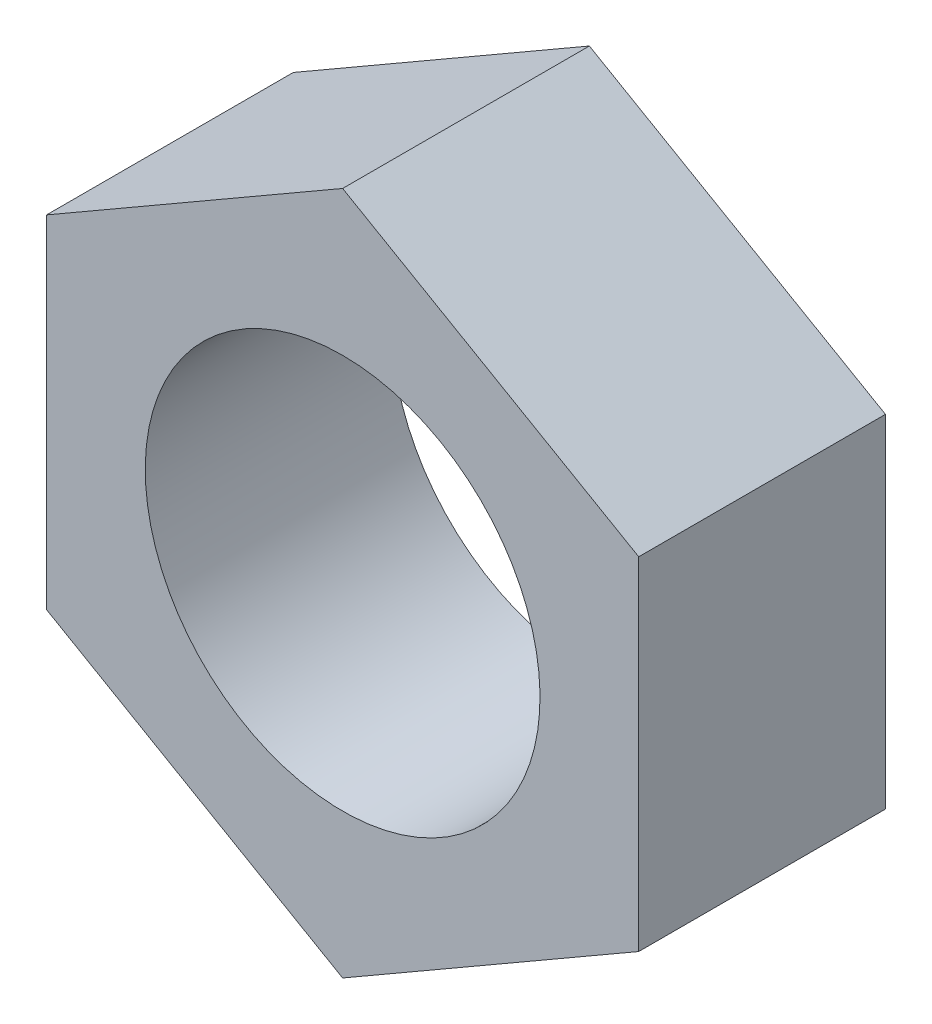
ISO-10303-21;
HEADER;
FILE_DESCRIPTION(('STEP AP214'),'2;1');
FILE_NAME('part.step','',(''),(''),'','','');
FILE_SCHEMA(('AUTOMOTIVE_DESIGN { 1 0 10303 214 1 1 1 1 }'));
ENDSEC;
DATA;
#1=APPLICATION_CONTEXT('core data for automotive mechanical design processes');
#2=APPLICATION_PROTOCOL_DEFINITION('international standard','automotive_design',2000,#1);
#3=PRODUCT_CONTEXT('',#1,'mechanical');
#4=PRODUCT('Part','Part','',(#3));
#5=PRODUCT_RELATED_PRODUCT_CATEGORY('part','',(#4));
#6=PRODUCT_DEFINITION_FORMATION('','',#4);
#7=PRODUCT_DEFINITION_CONTEXT('part definition',#1,'design');
#8=PRODUCT_DEFINITION('design','',#6,#7);
#9=PRODUCT_DEFINITION_SHAPE('','',#8);
#10=(LENGTH_UNIT() NAMED_UNIT(*) SI_UNIT(.MILLI.,.METRE.));
#11=(NAMED_UNIT(*) PLANE_ANGLE_UNIT() SI_UNIT($,.RADIAN.));
#12=(NAMED_UNIT(*) SI_UNIT($,.STERADIAN.) SOLID_ANGLE_UNIT());
#13=UNCERTAINTY_MEASURE_WITH_UNIT(LENGTH_MEASURE(1.E-05),#10,'distance_accuracy_value','');
#14=(GEOMETRIC_REPRESENTATION_CONTEXT(3) GLOBAL_UNCERTAINTY_ASSIGNED_CONTEXT((#13)) GLOBAL_UNIT_ASSIGNED_CONTEXT((#10,
#11,#12)) REPRESENTATION_CONTEXT('',''));
#15=CARTESIAN_POINT('',(0.,0.,0.));
#16=DIRECTION('',(0.,0.,1.));
#17=DIRECTION('',(1.,0.,0.));
#18=AXIS2_PLACEMENT_3D('',#15,#16,#17);
#19=CARTESIAN_POINT('',(-12.,-6.92820323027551,13.));
#20=DIRECTION('',(-1.,0.,0.));
#21=DIRECTION('',(0.,0.,1.));
#22=AXIS2_PLACEMENT_3D('',#19,#20,#21);
#23=PLANE('',#22);
#24=DIRECTION('',(0.,0.,-1.));
#25=VECTOR('',#24,1.);
#26=CARTESIAN_POINT('',(-12.,-6.92820323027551,13.));
#27=LINE('',#26,#25);
#28=CARTESIAN_POINT('',(-12.,-6.92820323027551,10.));
#29=VERTEX_POINT('',#28);
#30=CARTESIAN_POINT('',(-12.,-6.92820323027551,0.));
#31=VERTEX_POINT('',#30);
#32=EDGE_CURVE('E9',#29,#31,#27,.T.);
#33=ORIENTED_EDGE('',*,*,#32,.F.);
#34=DIRECTION('',(0.,-1.,0.));
#35=VECTOR('',#34,1.);
#36=CARTESIAN_POINT('',(-12.,6.92820323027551,10.));
#37=LINE('',#36,#35);
#38=CARTESIAN_POINT('',(-12.,6.92820323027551,10.));
#39=VERTEX_POINT('',#38);
#40=EDGE_CURVE('E117',#39,#29,#37,.T.);
#41=ORIENTED_EDGE('',*,*,#40,.F.);
#42=DIRECTION('',(0.,0.,-1.));
#43=VECTOR('',#42,1.);
#44=CARTESIAN_POINT('',(-12.,6.92820323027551,13.));
#45=LINE('',#44,#43);
#46=CARTESIAN_POINT('',(-12.,6.92820323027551,0.));
#47=VERTEX_POINT('',#46);
#48=EDGE_CURVE('E38',#39,#47,#45,.T.);
#49=ORIENTED_EDGE('',*,*,#48,.T.);
#50=DIRECTION('',(0.,1.,0.));
#51=VECTOR('',#50,1.);
#52=CARTESIAN_POINT('',(-12.,-6.92820323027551,0.));
#53=LINE('',#52,#51);
#54=EDGE_CURVE('E89',#31,#47,#53,.T.);
#55=ORIENTED_EDGE('',*,*,#54,.F.);
#56=EDGE_LOOP('',(#33,#41,#49,#55));
#57=FACE_BOUND('',#56,.T.);
#58=ADVANCED_FACE('F14',(#57),#23,.T.);
#59=CARTESIAN_POINT('',(-12.,-6.92820323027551,13.));
#60=DIRECTION('',(0.5,0.86602540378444,0.));
#61=DIRECTION('',(-0.86602540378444,0.5,0.));
#62=AXIS2_PLACEMENT_3D('',#59,#60,#61);
#63=PLANE('',#62);
#64=DIRECTION('',(0.866025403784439,-0.5,0.));
#65=VECTOR('',#64,1.);
#66=CARTESIAN_POINT('',(-12.,-6.92820323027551,10.));
#67=LINE('',#66,#65);
#68=CARTESIAN_POINT('',(0.,-13.856406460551,10.));
#69=VERTEX_POINT('',#68);
#70=EDGE_CURVE('E120',#29,#69,#67,.T.);
#71=ORIENTED_EDGE('',*,*,#70,.F.);
#72=ORIENTED_EDGE('',*,*,#32,.T.);
#73=DIRECTION('',(0.86602540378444,-0.5,0.));
#74=VECTOR('',#73,1.);
#75=CARTESIAN_POINT('',(-12.,-6.92820323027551,0.));
#76=LINE('',#75,#74);
#77=CARTESIAN_POINT('',(0.,-13.856406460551,0.));
#78=VERTEX_POINT('',#77);
#79=EDGE_CURVE('E84',#31,#78,#76,.T.);
#80=ORIENTED_EDGE('',*,*,#79,.T.);
#81=DIRECTION('',(0.,0.,-1.));
#82=VECTOR('',#81,1.);
#83=CARTESIAN_POINT('',(0.,-13.856406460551,13.));
#84=LINE('',#83,#82);
#85=EDGE_CURVE('E22',#69,#78,#84,.T.);
#86=ORIENTED_EDGE('',*,*,#85,.F.);
#87=EDGE_LOOP('',(#71,#72,#80,#86));
#88=FACE_BOUND('',#87,.T.);
#89=ADVANCED_FACE('F16',(#88),#63,.F.);
#90=CARTESIAN_POINT('',(12.,-6.9282032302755,13.));
#91=DIRECTION('',(0.5,-0.866025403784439,0.));
#92=DIRECTION('',(0.86602540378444,0.5,0.));
#93=AXIS2_PLACEMENT_3D('',#90,#91,#92);
#94=PLANE('',#93);
#95=DIRECTION('',(0.,0.,-1.));
#96=VECTOR('',#95,1.);
#97=CARTESIAN_POINT('',(12.,-6.9282032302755,13.));
#98=LINE('',#97,#96);
#99=CARTESIAN_POINT('',(12.,-6.9282032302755,10.));
#100=VERTEX_POINT('',#99);
#101=CARTESIAN_POINT('',(12.,-6.9282032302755,0.));
#102=VERTEX_POINT('',#101);
#103=EDGE_CURVE('E66',#100,#102,#98,.T.);
#104=ORIENTED_EDGE('',*,*,#103,.F.);
#105=DIRECTION('',(0.866025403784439,0.5,0.));
#106=VECTOR('',#105,1.);
#107=CARTESIAN_POINT('',(0.,-13.856406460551,10.));
#108=LINE('',#107,#106);
#109=EDGE_CURVE('E97',#69,#100,#108,.T.);
#110=ORIENTED_EDGE('',*,*,#109,.F.);
#111=ORIENTED_EDGE('',*,*,#85,.T.);
#112=DIRECTION('',(-0.866025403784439,-0.5,0.));
#113=VECTOR('',#112,1.);
#114=CARTESIAN_POINT('',(12.,-6.9282032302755,0.));
#115=LINE('',#114,#113);
#116=EDGE_CURVE('E82',#102,#78,#115,.T.);
#117=ORIENTED_EDGE('',*,*,#116,.F.);
#118=EDGE_LOOP('',(#104,#110,#111,#117));
#119=FACE_BOUND('',#118,.T.);
#120=ADVANCED_FACE('F94',(#119),#94,.T.);
#121=CARTESIAN_POINT('',(12.,-6.9282032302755,13.));
#122=DIRECTION('',(-1.,0.,0.));
#123=DIRECTION('',(0.,0.,1.));
#124=AXIS2_PLACEMENT_3D('',#121,#122,#123);
#125=PLANE('',#124);
#126=DIRECTION('',(0.,1.,0.));
#127=VECTOR('',#126,1.);
#128=CARTESIAN_POINT('',(12.,-6.9282032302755,10.));
#129=LINE('',#128,#127);
#130=CARTESIAN_POINT('',(12.,6.92820323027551,10.));
#131=VERTEX_POINT('',#130);
#132=EDGE_CURVE('E107',#100,#131,#129,.T.);
#133=ORIENTED_EDGE('',*,*,#132,.F.);
#134=ORIENTED_EDGE('',*,*,#103,.T.);
#135=DIRECTION('',(0.,1.,0.));
#136=VECTOR('',#135,1.);
#137=CARTESIAN_POINT('',(12.,-6.9282032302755,0.));
#138=LINE('',#137,#136);
#139=CARTESIAN_POINT('',(12.,6.92820323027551,0.));
#140=VERTEX_POINT('',#139);
#141=EDGE_CURVE('E75',#102,#140,#138,.T.);
#142=ORIENTED_EDGE('',*,*,#141,.T.);
#143=DIRECTION('',(0.,0.,-1.));
#144=VECTOR('',#143,1.);
#145=CARTESIAN_POINT('',(12.,6.92820323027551,13.));
#146=LINE('',#145,#144);
#147=EDGE_CURVE('E58',#131,#140,#146,.T.);
#148=ORIENTED_EDGE('',*,*,#147,.F.);
#149=EDGE_LOOP('',(#133,#134,#142,#148));
#150=FACE_BOUND('',#149,.T.);
#151=ADVANCED_FACE('F80',(#150),#125,.F.);
#152=CARTESIAN_POINT('',(12.,6.92820323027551,13.));
#153=DIRECTION('',(-0.5,-0.86602540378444,0.));
#154=DIRECTION('',(0.86602540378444,-0.5,0.));
#155=AXIS2_PLACEMENT_3D('',#152,#153,#154);
#156=PLANE('',#155);
#157=DIRECTION('',(-0.866025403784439,0.5,0.));
#158=VECTOR('',#157,1.);
#159=CARTESIAN_POINT('',(12.,6.92820323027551,10.));
#160=LINE('',#159,#158);
#161=CARTESIAN_POINT('',(0.,13.856406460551,10.));
#162=VERTEX_POINT('',#161);
#163=EDGE_CURVE('E29',#131,#162,#160,.T.);
#164=ORIENTED_EDGE('',*,*,#163,.F.);
#165=ORIENTED_EDGE('',*,*,#147,.T.);
#166=DIRECTION('',(-0.86602540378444,0.5,0.));
#167=VECTOR('',#166,1.);
#168=CARTESIAN_POINT('',(12.,6.92820323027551,0.));
#169=LINE('',#168,#167);
#170=CARTESIAN_POINT('',(0.,13.856406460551,0.));
#171=VERTEX_POINT('',#170);
#172=EDGE_CURVE('E62',#140,#171,#169,.T.);
#173=ORIENTED_EDGE('',*,*,#172,.T.);
#174=DIRECTION('',(0.,0.,-1.));
#175=VECTOR('',#174,1.);
#176=CARTESIAN_POINT('',(0.,13.856406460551,13.));
#177=LINE('',#176,#175);
#178=EDGE_CURVE('E67',#162,#171,#177,.T.);
#179=ORIENTED_EDGE('',*,*,#178,.F.);
#180=EDGE_LOOP('',(#164,#165,#173,#179));
#181=FACE_BOUND('',#180,.T.);
#182=ADVANCED_FACE('F60',(#181),#156,.F.);
#183=CARTESIAN_POINT('',(-12.,6.92820323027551,13.));
#184=DIRECTION('',(-0.5,0.86602540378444,0.));
#185=DIRECTION('',(-0.86602540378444,-0.5,0.));
#186=AXIS2_PLACEMENT_3D('',#183,#184,#185);
#187=PLANE('',#186);
#188=ORIENTED_EDGE('',*,*,#48,.F.);
#189=DIRECTION('',(-0.866025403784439,-0.5,0.));
#190=VECTOR('',#189,1.);
#191=CARTESIAN_POINT('',(0.,13.856406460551,10.));
#192=LINE('',#191,#190);
#193=EDGE_CURVE('E115',#162,#39,#192,.T.);
#194=ORIENTED_EDGE('',*,*,#193,.F.);
#195=ORIENTED_EDGE('',*,*,#178,.T.);
#196=DIRECTION('',(0.86602540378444,0.5,0.));
#197=VECTOR('',#196,1.);
#198=CARTESIAN_POINT('',(-12.,6.92820323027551,0.));
#199=LINE('',#198,#197);
#200=EDGE_CURVE('E78',#47,#171,#199,.T.);
#201=ORIENTED_EDGE('',*,*,#200,.F.);
#202=EDGE_LOOP('',(#188,#194,#195,#201));
#203=FACE_BOUND('',#202,.T.);
#204=ADVANCED_FACE('F113',(#203),#187,.T.);
#205=CARTESIAN_POINT('',(0.,0.,13.));
#206=DIRECTION('',(0.,0.,-1.));
#207=DIRECTION('',(0.,-1.,0.));
#208=AXIS2_PLACEMENT_3D('',#205,#206,#207);
#209=CYLINDRICAL_SURFACE('',#208,8.);
#210=CARTESIAN_POINT('',(0.,0.,0.));
#211=DIRECTION('',(0.,0.,1.));
#212=DIRECTION('',(0.,1.,0.));
#213=AXIS2_PLACEMENT_3D('',#210,#211,#212);
#214=CIRCLE('',#213,8.);
#215=CARTESIAN_POINT('',(0.,8.,0.));
#216=VERTEX_POINT('',#215);
#217=EDGE_CURVE('E103',#216,#216,#214,.T.);
#218=ORIENTED_EDGE('',*,*,#217,.F.);
#219=EDGE_LOOP('',(#218));
#220=FACE_BOUND('',#219,.T.);
#221=CARTESIAN_POINT('',(0.,0.,10.));
#222=DIRECTION('',(0.,0.,1.));
#223=DIRECTION('',(0.,1.,0.));
#224=AXIS2_PLACEMENT_3D('',#221,#222,#223);
#225=CIRCLE('',#224,8.);
#226=CARTESIAN_POINT('',(0.,8.,10.));
#227=VERTEX_POINT('',#226);
#228=EDGE_CURVE('E118',#227,#227,#225,.T.);
#229=ORIENTED_EDGE('',*,*,#228,.T.);
#230=EDGE_LOOP('',(#229));
#231=FACE_BOUND('',#230,.T.);
#232=ADVANCED_FACE('F145',(#220,#231),#209,.F.);
#233=CARTESIAN_POINT('',(-12.,6.92820323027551,0.));
#234=DIRECTION('',(0.,0.,-1.));
#235=DIRECTION('',(0.,-1.,0.));
#236=AXIS2_PLACEMENT_3D('',#233,#234,#235);
#237=PLANE('',#236);
#238=ORIENTED_EDGE('',*,*,#54,.T.);
#239=ORIENTED_EDGE('',*,*,#200,.T.);
#240=ORIENTED_EDGE('',*,*,#172,.F.);
#241=ORIENTED_EDGE('',*,*,#141,.F.);
#242=ORIENTED_EDGE('',*,*,#116,.T.);
#243=ORIENTED_EDGE('',*,*,#79,.F.);
#244=EDGE_LOOP('',(#238,#239,#240,#241,#242,#243));
#245=FACE_BOUND('',#244,.T.);
#246=ORIENTED_EDGE('',*,*,#217,.T.);
#247=EDGE_LOOP('',(#246));
#248=FACE_BOUND('',#247,.T.);
#249=ADVANCED_FACE('F72',(#245,#248),#237,.T.);
#250=CARTESIAN_POINT('',(-12.,6.92820323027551,10.));
#251=DIRECTION('',(0.,0.,1.));
#252=DIRECTION('',(0.,1.,0.));
#253=AXIS2_PLACEMENT_3D('',#250,#251,#252);
#254=PLANE('',#253);
#255=ORIENTED_EDGE('',*,*,#228,.F.);
#256=EDGE_LOOP('',(#255));
#257=FACE_BOUND('',#256,.T.);
#258=ORIENTED_EDGE('',*,*,#193,.T.);
#259=ORIENTED_EDGE('',*,*,#40,.T.);
#260=ORIENTED_EDGE('',*,*,#70,.T.);
#261=ORIENTED_EDGE('',*,*,#109,.T.);
#262=ORIENTED_EDGE('',*,*,#132,.T.);
#263=ORIENTED_EDGE('',*,*,#163,.T.);
#264=EDGE_LOOP('',(#258,#259,#260,#261,#262,#263));
#265=FACE_BOUND('',#264,.T.);
#266=ADVANCED_FACE('F127',(#257,#265),#254,.T.);
#267=CLOSED_SHELL('',(#58,#89,#120,#151,#182,#204,#232,#249,#266));
#268=MANIFOLD_SOLID_BREP('B1',#267);
#269=ADVANCED_BREP_SHAPE_REPRESENTATION('',(#18,#268),#14);
#270=SHAPE_DEFINITION_REPRESENTATION(#9,#269);
ENDSEC;
END-ISO-10303-21;
